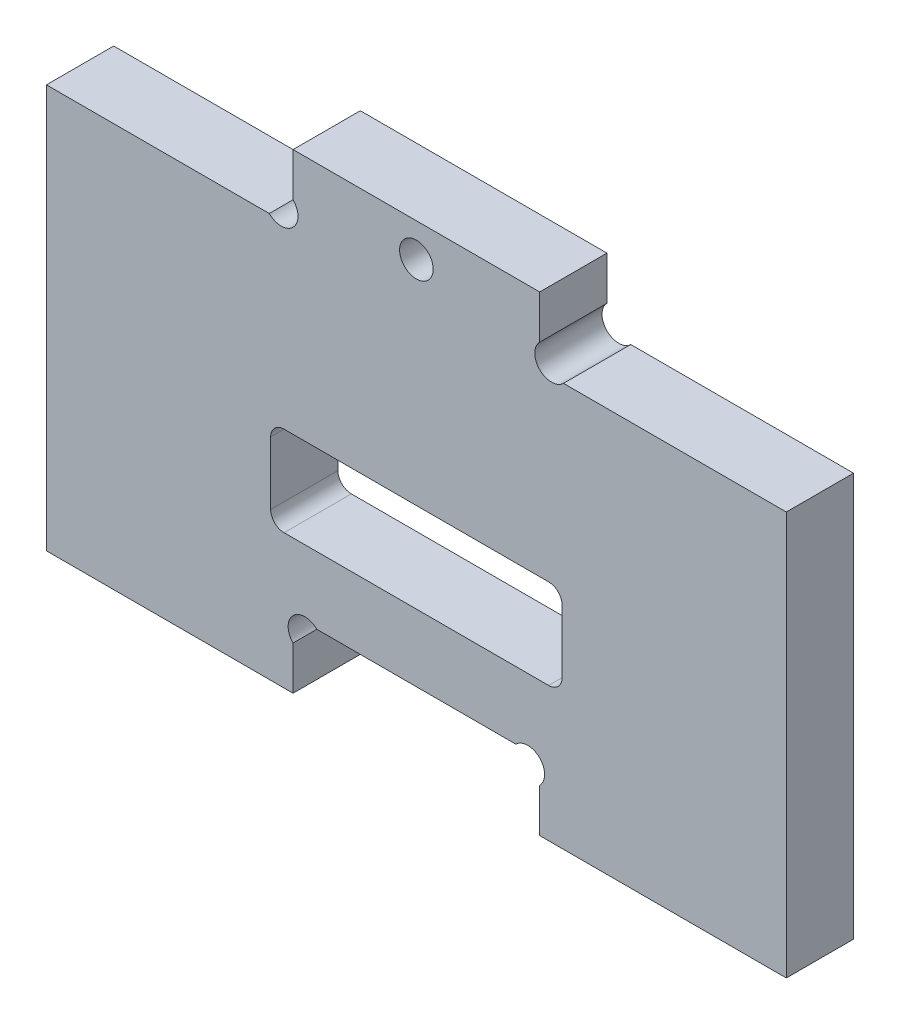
ISO-10303-21;
HEADER;
FILE_DESCRIPTION(('STEP AP214'),'2;1');
FILE_NAME('part.step','',(''),(''),'','','');
FILE_SCHEMA(('AUTOMOTIVE_DESIGN { 1 0 10303 214 1 1 1 1 }'));
ENDSEC;
DATA;
#1=APPLICATION_CONTEXT('core data for automotive mechanical design processes');
#2=APPLICATION_PROTOCOL_DEFINITION('international standard','automotive_design',2000,#1);
#3=PRODUCT_CONTEXT('',#1,'mechanical');
#4=PRODUCT('Part','Part','',(#3));
#5=PRODUCT_RELATED_PRODUCT_CATEGORY('part','',(#4));
#6=PRODUCT_DEFINITION_FORMATION('','',#4);
#7=PRODUCT_DEFINITION_CONTEXT('part definition',#1,'design');
#8=PRODUCT_DEFINITION('design','',#6,#7);
#9=PRODUCT_DEFINITION_SHAPE('','',#8);
#10=(LENGTH_UNIT() NAMED_UNIT(*) SI_UNIT(.MILLI.,.METRE.));
#11=(NAMED_UNIT(*) PLANE_ANGLE_UNIT() SI_UNIT($,.RADIAN.));
#12=(NAMED_UNIT(*) SI_UNIT($,.STERADIAN.) SOLID_ANGLE_UNIT());
#13=UNCERTAINTY_MEASURE_WITH_UNIT(LENGTH_MEASURE(1.E-05),#10,'distance_accuracy_value','');
#14=(GEOMETRIC_REPRESENTATION_CONTEXT(3) GLOBAL_UNCERTAINTY_ASSIGNED_CONTEXT((#13)) GLOBAL_UNIT_ASSIGNED_CONTEXT((#10,
#11,#12)) REPRESENTATION_CONTEXT('',''));
#15=CARTESIAN_POINT('',(0.,0.,0.));
#16=DIRECTION('',(0.,0.,1.));
#17=DIRECTION('',(1.,0.,0.));
#18=AXIS2_PLACEMENT_3D('',#15,#16,#17);
#19=CARTESIAN_POINT('',(23.0606601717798,4.93933982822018,6.));
#20=DIRECTION('',(0.,0.,1.));
#21=DIRECTION('',(1.,0.,0.));
#22=AXIS2_PLACEMENT_3D('',#19,#20,#21);
#23=PLANE('',#22);
#24=DIRECTION('',(0.,-1.,0.));
#25=VECTOR('',#24,1.);
#26=CARTESIAN_POINT('',(20.,18.8,6.));
#27=LINE('',#26,#25);
#28=CARTESIAN_POINT('',(20.,18.8,6.));
#29=VERTEX_POINT('',#28);
#30=CARTESIAN_POINT('',(20.,13.2,6.));
#31=VERTEX_POINT('',#30);
#32=EDGE_CURVE('E240',#29,#31,#27,.T.);
#33=ORIENTED_EDGE('',*,*,#32,.F.);
#34=CARTESIAN_POINT('',(21.2,18.8,6.));
#35=DIRECTION('',(0.,0.,1.));
#36=DIRECTION('',(-1.,0.,0.));
#37=AXIS2_PLACEMENT_3D('',#34,#35,#36);
#38=CIRCLE('',#37,1.2);
#39=CARTESIAN_POINT('',(21.2,20.,6.));
#40=VERTEX_POINT('',#39);
#41=EDGE_CURVE('E211',#40,#29,#38,.T.);
#42=ORIENTED_EDGE('',*,*,#41,.F.);
#43=DIRECTION('',(-1.,0.,0.));
#44=VECTOR('',#43,1.);
#45=CARTESIAN_POINT('',(21.2,20.,6.));
#46=LINE('',#45,#44);
#47=CARTESIAN_POINT('',(44.8,20.,6.));
#48=VERTEX_POINT('',#47);
#49=EDGE_CURVE('E252',#48,#40,#46,.T.);
#50=ORIENTED_EDGE('',*,*,#49,.F.);
#51=CARTESIAN_POINT('',(44.8,18.8,6.));
#52=DIRECTION('',(0.,0.,1.));
#53=DIRECTION('',(1.,0.,0.));
#54=AXIS2_PLACEMENT_3D('',#51,#52,#53);
#55=CIRCLE('',#54,1.2);
#56=CARTESIAN_POINT('',(46.,18.8,6.));
#57=VERTEX_POINT('',#56);
#58=EDGE_CURVE('E250',#57,#48,#55,.T.);
#59=ORIENTED_EDGE('',*,*,#58,.F.);
#60=DIRECTION('',(0.,1.,0.));
#61=VECTOR('',#60,1.);
#62=CARTESIAN_POINT('',(46.,18.8,6.));
#63=LINE('',#62,#61);
#64=CARTESIAN_POINT('',(46.,13.2,6.));
#65=VERTEX_POINT('',#64);
#66=EDGE_CURVE('E248',#65,#57,#63,.T.);
#67=ORIENTED_EDGE('',*,*,#66,.F.);
#68=CARTESIAN_POINT('',(44.8,13.2,6.));
#69=DIRECTION('',(0.,0.,1.));
#70=DIRECTION('',(-1.,0.,0.));
#71=AXIS2_PLACEMENT_3D('',#68,#69,#70);
#72=CIRCLE('',#71,1.2);
#73=CARTESIAN_POINT('',(44.8,12.,6.));
#74=VERTEX_POINT('',#73);
#75=EDGE_CURVE('E246',#74,#65,#72,.T.);
#76=ORIENTED_EDGE('',*,*,#75,.F.);
#77=DIRECTION('',(1.,0.,0.));
#78=VECTOR('',#77,1.);
#79=CARTESIAN_POINT('',(21.2,12.,6.));
#80=LINE('',#79,#78);
#81=CARTESIAN_POINT('',(21.2,12.,6.));
#82=VERTEX_POINT('',#81);
#83=EDGE_CURVE('E244',#82,#74,#80,.T.);
#84=ORIENTED_EDGE('',*,*,#83,.F.);
#85=CARTESIAN_POINT('',(21.2,13.2,6.));
#86=DIRECTION('',(0.,0.,1.));
#87=DIRECTION('',(1.,0.,0.));
#88=AXIS2_PLACEMENT_3D('',#85,#86,#87);
#89=CIRCLE('',#88,1.2);
#90=EDGE_CURVE('E242',#31,#82,#89,.T.);
#91=ORIENTED_EDGE('',*,*,#90,.F.);
#92=EDGE_LOOP('',(#33,#42,#50,#59,#67,#76,#84,#91));
#93=FACE_BOUND('',#92,.T.);
#94=CARTESIAN_POINT('',(23.0606601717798,4.93933982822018,6.));
#95=DIRECTION('',(0.,0.,-1.));
#96=DIRECTION('',(1.,0.,0.));
#97=AXIS2_PLACEMENT_3D('',#94,#95,#96);
#98=CIRCLE('',#97,1.5);
#99=CARTESIAN_POINT('',(22.,3.87867965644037,6.));
#100=VERTEX_POINT('',#99);
#101=CARTESIAN_POINT('',(24.1213203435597,5.99999999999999,6.));
#102=VERTEX_POINT('',#101);
#103=EDGE_CURVE('E298',#100,#102,#98,.T.);
#104=ORIENTED_EDGE('',*,*,#103,.T.);
#105=DIRECTION('',(1.,0.,0.));
#106=VECTOR('',#105,1.);
#107=CARTESIAN_POINT('',(41.8786796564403,5.99999999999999,6.));
#108=LINE('',#107,#106);
#109=CARTESIAN_POINT('',(41.8786796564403,5.99999999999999,6.));
#110=VERTEX_POINT('',#109);
#111=EDGE_CURVE('E301',#102,#110,#108,.T.);
#112=ORIENTED_EDGE('',*,*,#111,.T.);
#113=CARTESIAN_POINT('',(42.9393398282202,4.93933982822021,6.));
#114=DIRECTION('',(0.,0.,-1.));
#115=DIRECTION('',(-1.,0.,0.));
#116=AXIS2_PLACEMENT_3D('',#113,#114,#115);
#117=CIRCLE('',#116,1.5);
#118=CARTESIAN_POINT('',(44.,3.8786796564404,6.));
#119=VERTEX_POINT('',#118);
#120=EDGE_CURVE('E303',#110,#119,#117,.T.);
#121=ORIENTED_EDGE('',*,*,#120,.T.);
#122=DIRECTION('',(0.,-1.,0.));
#123=VECTOR('',#122,1.);
#124=CARTESIAN_POINT('',(44.,3.8786796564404,6.));
#125=LINE('',#124,#123);
#126=CARTESIAN_POINT('',(44.,0.,6.));
#127=VERTEX_POINT('',#126);
#128=EDGE_CURVE('E305',#119,#127,#125,.T.);
#129=ORIENTED_EDGE('',*,*,#128,.T.);
#130=DIRECTION('',(1.,0.,0.));
#131=VECTOR('',#130,1.);
#132=CARTESIAN_POINT('',(66.,0.,6.));
#133=LINE('',#132,#131);
#134=CARTESIAN_POINT('',(66.,0.,6.));
#135=VERTEX_POINT('',#134);
#136=EDGE_CURVE('E307',#127,#135,#133,.T.);
#137=ORIENTED_EDGE('',*,*,#136,.T.);
#138=DIRECTION('',(0.,1.,0.));
#139=VECTOR('',#138,1.);
#140=CARTESIAN_POINT('',(66.,36.,6.));
#141=LINE('',#140,#139);
#142=CARTESIAN_POINT('',(66.,36.,6.));
#143=VERTEX_POINT('',#142);
#144=EDGE_CURVE('E309',#135,#143,#141,.T.);
#145=ORIENTED_EDGE('',*,*,#144,.T.);
#146=DIRECTION('',(-1.,0.,0.));
#147=VECTOR('',#146,1.);
#148=CARTESIAN_POINT('',(46.1213203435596,36.,6.));
#149=LINE('',#148,#147);
#150=CARTESIAN_POINT('',(46.1213203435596,36.,6.));
#151=VERTEX_POINT('',#150);
#152=EDGE_CURVE('E311',#143,#151,#149,.T.);
#153=ORIENTED_EDGE('',*,*,#152,.T.);
#154=CARTESIAN_POINT('',(45.0606601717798,37.0606601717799,6.));
#155=DIRECTION('',(0.,0.,-1.));
#156=DIRECTION('',(-1.,0.,0.));
#157=AXIS2_PLACEMENT_3D('',#154,#155,#156);
#158=CIRCLE('',#157,1.5);
#159=CARTESIAN_POINT('',(44.,38.1213203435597,6.));
#160=VERTEX_POINT('',#159);
#161=EDGE_CURVE('E313',#151,#160,#158,.T.);
#162=ORIENTED_EDGE('',*,*,#161,.T.);
#163=DIRECTION('',(0.,1.,0.));
#164=VECTOR('',#163,1.);
#165=CARTESIAN_POINT('',(44.,38.1213203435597,6.));
#166=LINE('',#165,#164);
#167=CARTESIAN_POINT('',(44.,42.,6.));
#168=VERTEX_POINT('',#167);
#169=EDGE_CURVE('E315',#160,#168,#166,.T.);
#170=ORIENTED_EDGE('',*,*,#169,.T.);
#171=DIRECTION('',(-1.,0.,0.));
#172=VECTOR('',#171,1.);
#173=CARTESIAN_POINT('',(22.,42.,6.));
#174=LINE('',#173,#172);
#175=CARTESIAN_POINT('',(22.,42.,6.));
#176=VERTEX_POINT('',#175);
#177=EDGE_CURVE('E317',#168,#176,#174,.T.);
#178=ORIENTED_EDGE('',*,*,#177,.T.);
#179=DIRECTION('',(0.,-1.,0.));
#180=VECTOR('',#179,1.);
#181=CARTESIAN_POINT('',(22.,38.1213203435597,6.));
#182=LINE('',#181,#180);
#183=CARTESIAN_POINT('',(22.,38.1213203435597,6.));
#184=VERTEX_POINT('',#183);
#185=EDGE_CURVE('E319',#176,#184,#182,.T.);
#186=ORIENTED_EDGE('',*,*,#185,.T.);
#187=CARTESIAN_POINT('',(20.9393398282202,37.0606601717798,6.));
#188=DIRECTION('',(0.,0.,-1.));
#189=DIRECTION('',(1.,0.,0.));
#190=AXIS2_PLACEMENT_3D('',#187,#188,#189);
#191=CIRCLE('',#190,1.5);
#192=CARTESIAN_POINT('',(19.8786796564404,36.,6.));
#193=VERTEX_POINT('',#192);
#194=EDGE_CURVE('E321',#184,#193,#191,.T.);
#195=ORIENTED_EDGE('',*,*,#194,.T.);
#196=DIRECTION('',(-1.,0.,0.));
#197=VECTOR('',#196,1.);
#198=CARTESIAN_POINT('',(0.,36.,6.));
#199=LINE('',#198,#197);
#200=CARTESIAN_POINT('',(0.,36.,6.));
#201=VERTEX_POINT('',#200);
#202=EDGE_CURVE('E323',#193,#201,#199,.T.);
#203=ORIENTED_EDGE('',*,*,#202,.T.);
#204=DIRECTION('',(0.,-1.,0.));
#205=VECTOR('',#204,1.);
#206=CARTESIAN_POINT('',(0.,0.,6.));
#207=LINE('',#206,#205);
#208=CARTESIAN_POINT('',(0.,0.,6.));
#209=VERTEX_POINT('',#208);
#210=EDGE_CURVE('E325',#201,#209,#207,.T.);
#211=ORIENTED_EDGE('',*,*,#210,.T.);
#212=DIRECTION('',(1.,0.,0.));
#213=VECTOR('',#212,1.);
#214=CARTESIAN_POINT('',(22.,0.,6.));
#215=LINE('',#214,#213);
#216=CARTESIAN_POINT('',(22.,0.,6.));
#217=VERTEX_POINT('',#216);
#218=EDGE_CURVE('E327',#209,#217,#215,.T.);
#219=ORIENTED_EDGE('',*,*,#218,.T.);
#220=DIRECTION('',(0.,1.,0.));
#221=VECTOR('',#220,1.);
#222=CARTESIAN_POINT('',(22.,3.87867965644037,6.));
#223=LINE('',#222,#221);
#224=EDGE_CURVE('E329',#217,#100,#223,.T.);
#225=ORIENTED_EDGE('',*,*,#224,.T.);
#226=EDGE_LOOP('',(#104,#112,#121,#129,#137,#145,#153,#162,#170,#178,#186,#195,#203,#211,#219,#225));
#227=FACE_BOUND('',#226,.T.);
#228=CARTESIAN_POINT('',(33.,39.,6.));
#229=DIRECTION('',(0.,0.,1.));
#230=DIRECTION('',(1.,0.,0.));
#231=AXIS2_PLACEMENT_3D('',#228,#229,#230);
#232=CIRCLE('',#231,1.5);
#233=CARTESIAN_POINT('',(34.5,39.,6.));
#234=VERTEX_POINT('',#233);
#235=EDGE_CURVE('E219',#234,#234,#232,.T.);
#236=ORIENTED_EDGE('',*,*,#235,.F.);
#237=EDGE_LOOP('',(#236));
#238=FACE_BOUND('',#237,.T.);
#239=ADVANCED_FACE('F35',(#93,#227,#238),#23,.T.);
#240=CARTESIAN_POINT('',(23.0606601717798,4.93933982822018,0.));
#241=DIRECTION('',(0.,0.,1.));
#242=DIRECTION('',(1.,0.,0.));
#243=AXIS2_PLACEMENT_3D('',#240,#241,#242);
#244=PLANE('',#243);
#245=CARTESIAN_POINT('',(21.2,18.8,0.));
#246=DIRECTION('',(0.,0.,1.));
#247=DIRECTION('',(-1.,0.,0.));
#248=AXIS2_PLACEMENT_3D('',#245,#246,#247);
#249=CIRCLE('',#248,1.2);
#250=CARTESIAN_POINT('',(21.2,20.,0.));
#251=VERTEX_POINT('',#250);
#252=CARTESIAN_POINT('',(20.,18.8,0.));
#253=VERTEX_POINT('',#252);
#254=EDGE_CURVE('E58',#251,#253,#249,.T.);
#255=ORIENTED_EDGE('',*,*,#254,.T.);
#256=DIRECTION('',(0.,-1.,0.));
#257=VECTOR('',#256,1.);
#258=CARTESIAN_POINT('',(20.,18.8,0.));
#259=LINE('',#258,#257);
#260=CARTESIAN_POINT('',(20.,13.2,0.));
#261=VERTEX_POINT('',#260);
#262=EDGE_CURVE('E198',#253,#261,#259,.T.);
#263=ORIENTED_EDGE('',*,*,#262,.T.);
#264=CARTESIAN_POINT('',(21.2,13.2,0.));
#265=DIRECTION('',(0.,0.,1.));
#266=DIRECTION('',(1.,0.,0.));
#267=AXIS2_PLACEMENT_3D('',#264,#265,#266);
#268=CIRCLE('',#267,1.2);
#269=CARTESIAN_POINT('',(21.2,12.,0.));
#270=VERTEX_POINT('',#269);
#271=EDGE_CURVE('E207',#261,#270,#268,.T.);
#272=ORIENTED_EDGE('',*,*,#271,.T.);
#273=DIRECTION('',(1.,0.,0.));
#274=VECTOR('',#273,1.);
#275=CARTESIAN_POINT('',(21.2,12.,0.));
#276=LINE('',#275,#274);
#277=CARTESIAN_POINT('',(44.8,12.,0.));
#278=VERTEX_POINT('',#277);
#279=EDGE_CURVE('E227',#270,#278,#276,.T.);
#280=ORIENTED_EDGE('',*,*,#279,.T.);
#281=CARTESIAN_POINT('',(44.8,13.2,0.));
#282=DIRECTION('',(0.,0.,1.));
#283=DIRECTION('',(-1.,0.,0.));
#284=AXIS2_PLACEMENT_3D('',#281,#282,#283);
#285=CIRCLE('',#284,1.2);
#286=CARTESIAN_POINT('',(46.,13.2,0.));
#287=VERTEX_POINT('',#286);
#288=EDGE_CURVE('E230',#278,#287,#285,.T.);
#289=ORIENTED_EDGE('',*,*,#288,.T.);
#290=DIRECTION('',(0.,1.,0.));
#291=VECTOR('',#290,1.);
#292=CARTESIAN_POINT('',(46.,18.8,0.));
#293=LINE('',#292,#291);
#294=CARTESIAN_POINT('',(46.,18.8,0.));
#295=VERTEX_POINT('',#294);
#296=EDGE_CURVE('E233',#287,#295,#293,.T.);
#297=ORIENTED_EDGE('',*,*,#296,.T.);
#298=CARTESIAN_POINT('',(44.8,18.8,0.));
#299=DIRECTION('',(0.,0.,1.));
#300=DIRECTION('',(1.,0.,0.));
#301=AXIS2_PLACEMENT_3D('',#298,#299,#300);
#302=CIRCLE('',#301,1.2);
#303=CARTESIAN_POINT('',(44.8,20.,0.));
#304=VERTEX_POINT('',#303);
#305=EDGE_CURVE('E236',#295,#304,#302,.T.);
#306=ORIENTED_EDGE('',*,*,#305,.T.);
#307=DIRECTION('',(-1.,0.,0.));
#308=VECTOR('',#307,1.);
#309=CARTESIAN_POINT('',(21.2,20.,0.));
#310=LINE('',#309,#308);
#311=EDGE_CURVE('E218',#304,#251,#310,.T.);
#312=ORIENTED_EDGE('',*,*,#311,.T.);
#313=EDGE_LOOP('',(#255,#263,#272,#280,#289,#297,#306,#312));
#314=FACE_BOUND('',#313,.T.);
#315=CARTESIAN_POINT('',(23.0606601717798,4.93933982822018,0.));
#316=DIRECTION('',(0.,0.,-1.));
#317=DIRECTION('',(1.,0.,0.));
#318=AXIS2_PLACEMENT_3D('',#315,#316,#317);
#319=CIRCLE('',#318,1.5);
#320=CARTESIAN_POINT('',(22.,3.87867965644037,0.));
#321=VERTEX_POINT('',#320);
#322=CARTESIAN_POINT('',(24.1213203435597,5.99999999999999,0.));
#323=VERTEX_POINT('',#322);
#324=EDGE_CURVE('E212',#321,#323,#319,.T.);
#325=ORIENTED_EDGE('',*,*,#324,.F.);
#326=DIRECTION('',(0.,1.,0.));
#327=VECTOR('',#326,1.);
#328=CARTESIAN_POINT('',(22.,3.87867965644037,0.));
#329=LINE('',#328,#327);
#330=CARTESIAN_POINT('',(22.,0.,0.));
#331=VERTEX_POINT('',#330);
#332=EDGE_CURVE('E296',#331,#321,#329,.T.);
#333=ORIENTED_EDGE('',*,*,#332,.F.);
#334=DIRECTION('',(1.,0.,0.));
#335=VECTOR('',#334,1.);
#336=CARTESIAN_POINT('',(22.,0.,0.));
#337=LINE('',#336,#335);
#338=CARTESIAN_POINT('',(0.,0.,0.));
#339=VERTEX_POINT('',#338);
#340=EDGE_CURVE('E294',#339,#331,#337,.T.);
#341=ORIENTED_EDGE('',*,*,#340,.F.);
#342=DIRECTION('',(0.,-1.,0.));
#343=VECTOR('',#342,1.);
#344=CARTESIAN_POINT('',(0.,0.,0.));
#345=LINE('',#344,#343);
#346=CARTESIAN_POINT('',(0.,36.,0.));
#347=VERTEX_POINT('',#346);
#348=EDGE_CURVE('E292',#347,#339,#345,.T.);
#349=ORIENTED_EDGE('',*,*,#348,.F.);
#350=DIRECTION('',(-1.,0.,0.));
#351=VECTOR('',#350,1.);
#352=CARTESIAN_POINT('',(0.,36.,0.));
#353=LINE('',#352,#351);
#354=CARTESIAN_POINT('',(19.8786796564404,36.,0.));
#355=VERTEX_POINT('',#354);
#356=EDGE_CURVE('E290',#355,#347,#353,.T.);
#357=ORIENTED_EDGE('',*,*,#356,.F.);
#358=CARTESIAN_POINT('',(20.9393398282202,37.0606601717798,0.));
#359=DIRECTION('',(0.,0.,-1.));
#360=DIRECTION('',(1.,0.,0.));
#361=AXIS2_PLACEMENT_3D('',#358,#359,#360);
#362=CIRCLE('',#361,1.5);
#363=CARTESIAN_POINT('',(22.,38.1213203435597,0.));
#364=VERTEX_POINT('',#363);
#365=EDGE_CURVE('E288',#364,#355,#362,.T.);
#366=ORIENTED_EDGE('',*,*,#365,.F.);
#367=DIRECTION('',(0.,-1.,0.));
#368=VECTOR('',#367,1.);
#369=CARTESIAN_POINT('',(22.,38.1213203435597,0.));
#370=LINE('',#369,#368);
#371=CARTESIAN_POINT('',(22.,42.,0.));
#372=VERTEX_POINT('',#371);
#373=EDGE_CURVE('E286',#372,#364,#370,.T.);
#374=ORIENTED_EDGE('',*,*,#373,.F.);
#375=DIRECTION('',(-1.,0.,0.));
#376=VECTOR('',#375,1.);
#377=CARTESIAN_POINT('',(22.,42.,0.));
#378=LINE('',#377,#376);
#379=CARTESIAN_POINT('',(44.,42.,0.));
#380=VERTEX_POINT('',#379);
#381=EDGE_CURVE('E284',#380,#372,#378,.T.);
#382=ORIENTED_EDGE('',*,*,#381,.F.);
#383=DIRECTION('',(0.,1.,0.));
#384=VECTOR('',#383,1.);
#385=CARTESIAN_POINT('',(44.,38.1213203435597,0.));
#386=LINE('',#385,#384);
#387=CARTESIAN_POINT('',(44.,38.1213203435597,0.));
#388=VERTEX_POINT('',#387);
#389=EDGE_CURVE('E282',#388,#380,#386,.T.);
#390=ORIENTED_EDGE('',*,*,#389,.F.);
#391=CARTESIAN_POINT('',(45.0606601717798,37.0606601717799,0.));
#392=DIRECTION('',(0.,0.,-1.));
#393=DIRECTION('',(-1.,0.,0.));
#394=AXIS2_PLACEMENT_3D('',#391,#392,#393);
#395=CIRCLE('',#394,1.5);
#396=CARTESIAN_POINT('',(46.1213203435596,36.,0.));
#397=VERTEX_POINT('',#396);
#398=EDGE_CURVE('E280',#397,#388,#395,.T.);
#399=ORIENTED_EDGE('',*,*,#398,.F.);
#400=DIRECTION('',(-1.,0.,0.));
#401=VECTOR('',#400,1.);
#402=CARTESIAN_POINT('',(46.1213203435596,36.,0.));
#403=LINE('',#402,#401);
#404=CARTESIAN_POINT('',(66.,36.,0.));
#405=VERTEX_POINT('',#404);
#406=EDGE_CURVE('E278',#405,#397,#403,.T.);
#407=ORIENTED_EDGE('',*,*,#406,.F.);
#408=DIRECTION('',(0.,1.,0.));
#409=VECTOR('',#408,1.);
#410=CARTESIAN_POINT('',(66.,36.,0.));
#411=LINE('',#410,#409);
#412=CARTESIAN_POINT('',(66.,0.,0.));
#413=VERTEX_POINT('',#412);
#414=EDGE_CURVE('E276',#413,#405,#411,.T.);
#415=ORIENTED_EDGE('',*,*,#414,.F.);
#416=DIRECTION('',(1.,0.,0.));
#417=VECTOR('',#416,1.);
#418=CARTESIAN_POINT('',(66.,0.,0.));
#419=LINE('',#418,#417);
#420=CARTESIAN_POINT('',(44.,0.,0.));
#421=VERTEX_POINT('',#420);
#422=EDGE_CURVE('E274',#421,#413,#419,.T.);
#423=ORIENTED_EDGE('',*,*,#422,.F.);
#424=DIRECTION('',(0.,-1.,0.));
#425=VECTOR('',#424,1.);
#426=CARTESIAN_POINT('',(44.,3.8786796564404,0.));
#427=LINE('',#426,#425);
#428=CARTESIAN_POINT('',(44.,3.8786796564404,0.));
#429=VERTEX_POINT('',#428);
#430=EDGE_CURVE('E272',#429,#421,#427,.T.);
#431=ORIENTED_EDGE('',*,*,#430,.F.);
#432=CARTESIAN_POINT('',(42.9393398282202,4.93933982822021,0.));
#433=DIRECTION('',(0.,0.,-1.));
#434=DIRECTION('',(-1.,0.,0.));
#435=AXIS2_PLACEMENT_3D('',#432,#433,#434);
#436=CIRCLE('',#435,1.5);
#437=CARTESIAN_POINT('',(41.8786796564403,5.99999999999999,0.));
#438=VERTEX_POINT('',#437);
#439=EDGE_CURVE('E270',#438,#429,#436,.T.);
#440=ORIENTED_EDGE('',*,*,#439,.F.);
#441=DIRECTION('',(1.,0.,0.));
#442=VECTOR('',#441,1.);
#443=CARTESIAN_POINT('',(41.8786796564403,5.99999999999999,0.));
#444=LINE('',#443,#442);
#445=EDGE_CURVE('E268',#323,#438,#444,.T.);
#446=ORIENTED_EDGE('',*,*,#445,.F.);
#447=EDGE_LOOP('',(#325,#333,#341,#349,#357,#366,#374,#382,#390,#399,#407,#415,#423,#431,#440,#446));
#448=FACE_BOUND('',#447,.T.);
#449=CARTESIAN_POINT('',(33.,39.,0.));
#450=DIRECTION('',(0.,0.,1.));
#451=DIRECTION('',(1.,0.,0.));
#452=AXIS2_PLACEMENT_3D('',#449,#450,#451);
#453=CIRCLE('',#452,1.5);
#454=CARTESIAN_POINT('',(34.5,39.,0.));
#455=VERTEX_POINT('',#454);
#456=EDGE_CURVE('E222',#455,#455,#453,.T.);
#457=ORIENTED_EDGE('',*,*,#456,.T.);
#458=EDGE_LOOP('',(#457));
#459=FACE_BOUND('',#458,.T.);
#460=ADVANCED_FACE('F215',(#314,#448,#459),#244,.F.);
#461=CARTESIAN_POINT('',(23.0606601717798,4.93933982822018,6.));
#462=DIRECTION('',(0.,0.,-1.));
#463=DIRECTION('',(-1.,0.,0.));
#464=AXIS2_PLACEMENT_3D('',#461,#462,#463);
#465=CYLINDRICAL_SURFACE('',#464,1.5);
#466=ORIENTED_EDGE('',*,*,#324,.T.);
#467=DIRECTION('',(0.,0.,-1.));
#468=VECTOR('',#467,1.);
#469=CARTESIAN_POINT('',(24.1213203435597,5.99999999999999,6.));
#470=LINE('',#469,#468);
#471=EDGE_CURVE('E11',#102,#323,#470,.T.);
#472=ORIENTED_EDGE('',*,*,#471,.F.);
#473=ORIENTED_EDGE('',*,*,#103,.F.);
#474=DIRECTION('',(0.,0.,-1.));
#475=VECTOR('',#474,1.);
#476=CARTESIAN_POINT('',(22.,3.87867965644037,6.));
#477=LINE('',#476,#475);
#478=EDGE_CURVE('E331',#100,#321,#477,.T.);
#479=ORIENTED_EDGE('',*,*,#478,.T.);
#480=EDGE_LOOP('',(#466,#472,#473,#479));
#481=FACE_BOUND('',#480,.T.);
#482=ADVANCED_FACE('F37',(#481),#465,.F.);
#483=CARTESIAN_POINT('',(41.8786796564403,5.99999999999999,6.));
#484=DIRECTION('',(0.,1.,0.));
#485=DIRECTION('',(-1.,0.,0.));
#486=AXIS2_PLACEMENT_3D('',#483,#484,#485);
#487=PLANE('',#486);
#488=ORIENTED_EDGE('',*,*,#445,.T.);
#489=DIRECTION('',(0.,0.,-1.));
#490=VECTOR('',#489,1.);
#491=CARTESIAN_POINT('',(41.8786796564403,5.99999999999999,6.));
#492=LINE('',#491,#490);
#493=EDGE_CURVE('E43',#110,#438,#492,.T.);
#494=ORIENTED_EDGE('',*,*,#493,.F.);
#495=ORIENTED_EDGE('',*,*,#111,.F.);
#496=ORIENTED_EDGE('',*,*,#471,.T.);
#497=EDGE_LOOP('',(#488,#494,#495,#496));
#498=FACE_BOUND('',#497,.T.);
#499=ADVANCED_FACE('F399',(#498),#487,.F.);
#500=CARTESIAN_POINT('',(42.9393398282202,4.93933982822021,6.));
#501=DIRECTION('',(0.,0.,-1.));
#502=DIRECTION('',(-1.,0.,0.));
#503=AXIS2_PLACEMENT_3D('',#500,#501,#502);
#504=CYLINDRICAL_SURFACE('',#503,1.5);
#505=ORIENTED_EDGE('',*,*,#439,.T.);
#506=DIRECTION('',(0.,0.,-1.));
#507=VECTOR('',#506,1.);
#508=CARTESIAN_POINT('',(44.,3.8786796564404,6.));
#509=LINE('',#508,#507);
#510=EDGE_CURVE('E370',#119,#429,#509,.T.);
#511=ORIENTED_EDGE('',*,*,#510,.F.);
#512=ORIENTED_EDGE('',*,*,#120,.F.);
#513=ORIENTED_EDGE('',*,*,#493,.T.);
#514=EDGE_LOOP('',(#505,#511,#512,#513));
#515=FACE_BOUND('',#514,.T.);
#516=ADVANCED_FACE('F377',(#515),#504,.F.);
#517=CARTESIAN_POINT('',(44.,3.8786796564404,6.));
#518=DIRECTION('',(1.,0.,0.));
#519=DIRECTION('',(0.,0.,-1.));
#520=AXIS2_PLACEMENT_3D('',#517,#518,#519);
#521=PLANE('',#520);
#522=ORIENTED_EDGE('',*,*,#430,.T.);
#523=DIRECTION('',(0.,0.,-1.));
#524=VECTOR('',#523,1.);
#525=CARTESIAN_POINT('',(44.,0.,6.));
#526=LINE('',#525,#524);
#527=EDGE_CURVE('E367',#127,#421,#526,.T.);
#528=ORIENTED_EDGE('',*,*,#527,.F.);
#529=ORIENTED_EDGE('',*,*,#128,.F.);
#530=ORIENTED_EDGE('',*,*,#510,.T.);
#531=EDGE_LOOP('',(#522,#528,#529,#530));
#532=FACE_BOUND('',#531,.T.);
#533=ADVANCED_FACE('F387',(#532),#521,.F.);
#534=CARTESIAN_POINT('',(66.,0.,6.));
#535=DIRECTION('',(0.,1.,0.));
#536=DIRECTION('',(-1.,0.,0.));
#537=AXIS2_PLACEMENT_3D('',#534,#535,#536);
#538=PLANE('',#537);
#539=ORIENTED_EDGE('',*,*,#422,.T.);
#540=DIRECTION('',(0.,0.,-1.));
#541=VECTOR('',#540,1.);
#542=CARTESIAN_POINT('',(66.,0.,6.));
#543=LINE('',#542,#541);
#544=EDGE_CURVE('E364',#135,#413,#543,.T.);
#545=ORIENTED_EDGE('',*,*,#544,.F.);
#546=ORIENTED_EDGE('',*,*,#136,.F.);
#547=ORIENTED_EDGE('',*,*,#527,.T.);
#548=EDGE_LOOP('',(#539,#545,#546,#547));
#549=FACE_BOUND('',#548,.T.);
#550=ADVANCED_FACE('F391',(#549),#538,.F.);
#551=CARTESIAN_POINT('',(66.,36.,6.));
#552=DIRECTION('',(-1.,0.,0.));
#553=DIRECTION('',(0.,-1.,0.));
#554=AXIS2_PLACEMENT_3D('',#551,#552,#553);
#555=PLANE('',#554);
#556=ORIENTED_EDGE('',*,*,#414,.T.);
#557=DIRECTION('',(0.,0.,-1.));
#558=VECTOR('',#557,1.);
#559=CARTESIAN_POINT('',(66.,36.,6.));
#560=LINE('',#559,#558);
#561=EDGE_CURVE('E361',#143,#405,#560,.T.);
#562=ORIENTED_EDGE('',*,*,#561,.F.);
#563=ORIENTED_EDGE('',*,*,#144,.F.);
#564=ORIENTED_EDGE('',*,*,#544,.T.);
#565=EDGE_LOOP('',(#556,#562,#563,#564));
#566=FACE_BOUND('',#565,.T.);
#567=ADVANCED_FACE('F452',(#566),#555,.F.);
#568=CARTESIAN_POINT('',(46.1213203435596,36.,6.));
#569=DIRECTION('',(0.,-1.,0.));
#570=DIRECTION('',(1.,0.,0.));
#571=AXIS2_PLACEMENT_3D('',#568,#569,#570);
#572=PLANE('',#571);
#573=ORIENTED_EDGE('',*,*,#406,.T.);
#574=DIRECTION('',(0.,0.,-1.));
#575=VECTOR('',#574,1.);
#576=CARTESIAN_POINT('',(46.1213203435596,36.,6.));
#577=LINE('',#576,#575);
#578=EDGE_CURVE('E358',#151,#397,#577,.T.);
#579=ORIENTED_EDGE('',*,*,#578,.F.);
#580=ORIENTED_EDGE('',*,*,#152,.F.);
#581=ORIENTED_EDGE('',*,*,#561,.T.);
#582=EDGE_LOOP('',(#573,#579,#580,#581));
#583=FACE_BOUND('',#582,.T.);
#584=ADVANCED_FACE('F449',(#583),#572,.F.);
#585=CARTESIAN_POINT('',(45.0606601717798,37.0606601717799,6.));
#586=DIRECTION('',(0.,0.,-1.));
#587=DIRECTION('',(-1.,0.,0.));
#588=AXIS2_PLACEMENT_3D('',#585,#586,#587);
#589=CYLINDRICAL_SURFACE('',#588,1.5);
#590=ORIENTED_EDGE('',*,*,#398,.T.);
#591=DIRECTION('',(0.,0.,-1.));
#592=VECTOR('',#591,1.);
#593=CARTESIAN_POINT('',(44.,38.1213203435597,6.));
#594=LINE('',#593,#592);
#595=EDGE_CURVE('E355',#160,#388,#594,.T.);
#596=ORIENTED_EDGE('',*,*,#595,.F.);
#597=ORIENTED_EDGE('',*,*,#161,.F.);
#598=ORIENTED_EDGE('',*,*,#578,.T.);
#599=EDGE_LOOP('',(#590,#596,#597,#598));
#600=FACE_BOUND('',#599,.T.);
#601=ADVANCED_FACE('F445',(#600),#589,.F.);
#602=CARTESIAN_POINT('',(44.,38.1213203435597,6.));
#603=DIRECTION('',(-1.,0.,0.));
#604=DIRECTION('',(0.,0.,1.));
#605=AXIS2_PLACEMENT_3D('',#602,#603,#604);
#606=PLANE('',#605);
#607=ORIENTED_EDGE('',*,*,#389,.T.);
#608=DIRECTION('',(0.,0.,-1.));
#609=VECTOR('',#608,1.);
#610=CARTESIAN_POINT('',(44.,42.,6.));
#611=LINE('',#610,#609);
#612=EDGE_CURVE('E352',#168,#380,#611,.T.);
#613=ORIENTED_EDGE('',*,*,#612,.F.);
#614=ORIENTED_EDGE('',*,*,#169,.F.);
#615=ORIENTED_EDGE('',*,*,#595,.T.);
#616=EDGE_LOOP('',(#607,#613,#614,#615));
#617=FACE_BOUND('',#616,.T.);
#618=ADVANCED_FACE('F441',(#617),#606,.F.);
#619=CARTESIAN_POINT('',(22.,42.,6.));
#620=DIRECTION('',(0.,-1.,0.));
#621=DIRECTION('',(1.,0.,0.));
#622=AXIS2_PLACEMENT_3D('',#619,#620,#621);
#623=PLANE('',#622);
#624=ORIENTED_EDGE('',*,*,#381,.T.);
#625=DIRECTION('',(0.,0.,-1.));
#626=VECTOR('',#625,1.);
#627=CARTESIAN_POINT('',(22.,42.,6.));
#628=LINE('',#627,#626);
#629=EDGE_CURVE('E349',#176,#372,#628,.T.);
#630=ORIENTED_EDGE('',*,*,#629,.F.);
#631=ORIENTED_EDGE('',*,*,#177,.F.);
#632=ORIENTED_EDGE('',*,*,#612,.T.);
#633=EDGE_LOOP('',(#624,#630,#631,#632));
#634=FACE_BOUND('',#633,.T.);
#635=ADVANCED_FACE('F436',(#634),#623,.F.);
#636=CARTESIAN_POINT('',(22.,38.1213203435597,6.));
#637=DIRECTION('',(1.,0.,0.));
#638=DIRECTION('',(0.,0.,-1.));
#639=AXIS2_PLACEMENT_3D('',#636,#637,#638);
#640=PLANE('',#639);
#641=ORIENTED_EDGE('',*,*,#373,.T.);
#642=DIRECTION('',(0.,0.,-1.));
#643=VECTOR('',#642,1.);
#644=CARTESIAN_POINT('',(22.,38.1213203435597,6.));
#645=LINE('',#644,#643);
#646=EDGE_CURVE('E346',#184,#364,#645,.T.);
#647=ORIENTED_EDGE('',*,*,#646,.F.);
#648=ORIENTED_EDGE('',*,*,#185,.F.);
#649=ORIENTED_EDGE('',*,*,#629,.T.);
#650=EDGE_LOOP('',(#641,#647,#648,#649));
#651=FACE_BOUND('',#650,.T.);
#652=ADVANCED_FACE('F430',(#651),#640,.F.);
#653=CARTESIAN_POINT('',(20.9393398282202,37.0606601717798,6.));
#654=DIRECTION('',(0.,0.,-1.));
#655=DIRECTION('',(-1.,0.,0.));
#656=AXIS2_PLACEMENT_3D('',#653,#654,#655);
#657=CYLINDRICAL_SURFACE('',#656,1.5);
#658=ORIENTED_EDGE('',*,*,#365,.T.);
#659=DIRECTION('',(0.,0.,-1.));
#660=VECTOR('',#659,1.);
#661=CARTESIAN_POINT('',(19.8786796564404,36.,6.));
#662=LINE('',#661,#660);
#663=EDGE_CURVE('E343',#193,#355,#662,.T.);
#664=ORIENTED_EDGE('',*,*,#663,.F.);
#665=ORIENTED_EDGE('',*,*,#194,.F.);
#666=ORIENTED_EDGE('',*,*,#646,.T.);
#667=EDGE_LOOP('',(#658,#664,#665,#666));
#668=FACE_BOUND('',#667,.T.);
#669=ADVANCED_FACE('F426',(#668),#657,.F.);
#670=CARTESIAN_POINT('',(0.,36.,6.));
#671=DIRECTION('',(0.,-1.,0.));
#672=DIRECTION('',(1.,0.,0.));
#673=AXIS2_PLACEMENT_3D('',#670,#671,#672);
#674=PLANE('',#673);
#675=ORIENTED_EDGE('',*,*,#356,.T.);
#676=DIRECTION('',(0.,0.,-1.));
#677=VECTOR('',#676,1.);
#678=CARTESIAN_POINT('',(0.,36.,6.));
#679=LINE('',#678,#677);
#680=EDGE_CURVE('E340',#201,#347,#679,.T.);
#681=ORIENTED_EDGE('',*,*,#680,.F.);
#682=ORIENTED_EDGE('',*,*,#202,.F.);
#683=ORIENTED_EDGE('',*,*,#663,.T.);
#684=EDGE_LOOP('',(#675,#681,#682,#683));
#685=FACE_BOUND('',#684,.T.);
#686=ADVANCED_FACE('F421',(#685),#674,.F.);
#687=CARTESIAN_POINT('',(0.,0.,6.));
#688=DIRECTION('',(1.,0.,0.));
#689=DIRECTION('',(0.,0.,-1.));
#690=AXIS2_PLACEMENT_3D('',#687,#688,#689);
#691=PLANE('',#690);
#692=ORIENTED_EDGE('',*,*,#348,.T.);
#693=DIRECTION('',(0.,0.,-1.));
#694=VECTOR('',#693,1.);
#695=CARTESIAN_POINT('',(0.,0.,6.));
#696=LINE('',#695,#694);
#697=EDGE_CURVE('E337',#209,#339,#696,.T.);
#698=ORIENTED_EDGE('',*,*,#697,.F.);
#699=ORIENTED_EDGE('',*,*,#210,.F.);
#700=ORIENTED_EDGE('',*,*,#680,.T.);
#701=EDGE_LOOP('',(#692,#698,#699,#700));
#702=FACE_BOUND('',#701,.T.);
#703=ADVANCED_FACE('F415',(#702),#691,.F.);
#704=CARTESIAN_POINT('',(22.,0.,6.));
#705=DIRECTION('',(0.,1.,0.));
#706=DIRECTION('',(0.,0.,1.));
#707=AXIS2_PLACEMENT_3D('',#704,#705,#706);
#708=PLANE('',#707);
#709=ORIENTED_EDGE('',*,*,#340,.T.);
#710=DIRECTION('',(0.,0.,-1.));
#711=VECTOR('',#710,1.);
#712=CARTESIAN_POINT('',(22.,0.,6.));
#713=LINE('',#712,#711);
#714=EDGE_CURVE('E334',#217,#331,#713,.T.);
#715=ORIENTED_EDGE('',*,*,#714,.F.);
#716=ORIENTED_EDGE('',*,*,#218,.F.);
#717=ORIENTED_EDGE('',*,*,#697,.T.);
#718=EDGE_LOOP('',(#709,#715,#716,#717));
#719=FACE_BOUND('',#718,.T.);
#720=ADVANCED_FACE('F411',(#719),#708,.F.);
#721=CARTESIAN_POINT('',(22.,3.87867965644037,6.));
#722=DIRECTION('',(-1.,0.,0.));
#723=DIRECTION('',(0.,0.,1.));
#724=AXIS2_PLACEMENT_3D('',#721,#722,#723);
#725=PLANE('',#724);
#726=ORIENTED_EDGE('',*,*,#332,.T.);
#727=ORIENTED_EDGE('',*,*,#478,.F.);
#728=ORIENTED_EDGE('',*,*,#224,.F.);
#729=ORIENTED_EDGE('',*,*,#714,.T.);
#730=EDGE_LOOP('',(#726,#727,#728,#729));
#731=FACE_BOUND('',#730,.T.);
#732=ADVANCED_FACE('F406',(#731),#725,.F.);
#733=CARTESIAN_POINT('',(21.2,18.8,6.));
#734=DIRECTION('',(0.,0.,-1.));
#735=DIRECTION('',(-1.,0.,0.));
#736=AXIS2_PLACEMENT_3D('',#733,#734,#735);
#737=CYLINDRICAL_SURFACE('',#736,1.2);
#738=ORIENTED_EDGE('',*,*,#254,.F.);
#739=DIRECTION('',(0.,0.,-1.));
#740=VECTOR('',#739,1.);
#741=CARTESIAN_POINT('',(21.2,20.,6.));
#742=LINE('',#741,#740);
#743=EDGE_CURVE('E254',#40,#251,#742,.T.);
#744=ORIENTED_EDGE('',*,*,#743,.F.);
#745=ORIENTED_EDGE('',*,*,#41,.T.);
#746=DIRECTION('',(0.,0.,-1.));
#747=VECTOR('',#746,1.);
#748=CARTESIAN_POINT('',(20.,18.8,6.));
#749=LINE('',#748,#747);
#750=EDGE_CURVE('E200',#29,#253,#749,.T.);
#751=ORIENTED_EDGE('',*,*,#750,.T.);
#752=EDGE_LOOP('',(#738,#744,#745,#751));
#753=FACE_BOUND('',#752,.T.);
#754=ADVANCED_FACE('F209',(#753),#737,.F.);
#755=CARTESIAN_POINT('',(20.,18.8,6.));
#756=DIRECTION('',(1.,0.,0.));
#757=DIRECTION('',(0.,0.,-1.));
#758=AXIS2_PLACEMENT_3D('',#755,#756,#757);
#759=PLANE('',#758);
#760=ORIENTED_EDGE('',*,*,#262,.F.);
#761=ORIENTED_EDGE('',*,*,#750,.F.);
#762=ORIENTED_EDGE('',*,*,#32,.T.);
#763=DIRECTION('',(0.,0.,-1.));
#764=VECTOR('',#763,1.);
#765=CARTESIAN_POINT('',(20.,13.2,6.));
#766=LINE('',#765,#764);
#767=EDGE_CURVE('E203',#31,#261,#766,.T.);
#768=ORIENTED_EDGE('',*,*,#767,.T.);
#769=EDGE_LOOP('',(#760,#761,#762,#768));
#770=FACE_BOUND('',#769,.T.);
#771=ADVANCED_FACE('F199',(#770),#759,.T.);
#772=CARTESIAN_POINT('',(21.2,13.2,6.));
#773=DIRECTION('',(0.,0.,-1.));
#774=DIRECTION('',(-1.,0.,0.));
#775=AXIS2_PLACEMENT_3D('',#772,#773,#774);
#776=CYLINDRICAL_SURFACE('',#775,1.2);
#777=ORIENTED_EDGE('',*,*,#271,.F.);
#778=ORIENTED_EDGE('',*,*,#767,.F.);
#779=ORIENTED_EDGE('',*,*,#90,.T.);
#780=DIRECTION('',(0.,0.,-1.));
#781=VECTOR('',#780,1.);
#782=CARTESIAN_POINT('',(21.2,12.,6.));
#783=LINE('',#782,#781);
#784=EDGE_CURVE('E263',#82,#270,#783,.T.);
#785=ORIENTED_EDGE('',*,*,#784,.T.);
#786=EDGE_LOOP('',(#777,#778,#779,#785));
#787=FACE_BOUND('',#786,.T.);
#788=ADVANCED_FACE('F534',(#787),#776,.F.);
#789=CARTESIAN_POINT('',(21.2,12.,6.));
#790=DIRECTION('',(0.,1.,0.));
#791=DIRECTION('',(-1.,0.,0.));
#792=AXIS2_PLACEMENT_3D('',#789,#790,#791);
#793=PLANE('',#792);
#794=ORIENTED_EDGE('',*,*,#279,.F.);
#795=ORIENTED_EDGE('',*,*,#784,.F.);
#796=ORIENTED_EDGE('',*,*,#83,.T.);
#797=DIRECTION('',(0.,0.,-1.));
#798=VECTOR('',#797,1.);
#799=CARTESIAN_POINT('',(44.8,12.,6.));
#800=LINE('',#799,#798);
#801=EDGE_CURVE('E261',#74,#278,#800,.T.);
#802=ORIENTED_EDGE('',*,*,#801,.T.);
#803=EDGE_LOOP('',(#794,#795,#796,#802));
#804=FACE_BOUND('',#803,.T.);
#805=ADVANCED_FACE('F541',(#804),#793,.T.);
#806=CARTESIAN_POINT('',(44.8,13.2,6.));
#807=DIRECTION('',(0.,0.,-1.));
#808=DIRECTION('',(-1.,0.,0.));
#809=AXIS2_PLACEMENT_3D('',#806,#807,#808);
#810=CYLINDRICAL_SURFACE('',#809,1.2);
#811=ORIENTED_EDGE('',*,*,#288,.F.);
#812=ORIENTED_EDGE('',*,*,#801,.F.);
#813=ORIENTED_EDGE('',*,*,#75,.T.);
#814=DIRECTION('',(0.,0.,-1.));
#815=VECTOR('',#814,1.);
#816=CARTESIAN_POINT('',(46.,13.2,6.));
#817=LINE('',#816,#815);
#818=EDGE_CURVE('E259',#65,#287,#817,.T.);
#819=ORIENTED_EDGE('',*,*,#818,.T.);
#820=EDGE_LOOP('',(#811,#812,#813,#819));
#821=FACE_BOUND('',#820,.T.);
#822=ADVANCED_FACE('F549',(#821),#810,.F.);
#823=CARTESIAN_POINT('',(46.,18.8,6.));
#824=DIRECTION('',(-1.,0.,0.));
#825=DIRECTION('',(0.,0.,1.));
#826=AXIS2_PLACEMENT_3D('',#823,#824,#825);
#827=PLANE('',#826);
#828=ORIENTED_EDGE('',*,*,#296,.F.);
#829=ORIENTED_EDGE('',*,*,#818,.F.);
#830=ORIENTED_EDGE('',*,*,#66,.T.);
#831=DIRECTION('',(0.,0.,-1.));
#832=VECTOR('',#831,1.);
#833=CARTESIAN_POINT('',(46.,18.8,6.));
#834=LINE('',#833,#832);
#835=EDGE_CURVE('E257',#57,#295,#834,.T.);
#836=ORIENTED_EDGE('',*,*,#835,.T.);
#837=EDGE_LOOP('',(#828,#829,#830,#836));
#838=FACE_BOUND('',#837,.T.);
#839=ADVANCED_FACE('F557',(#838),#827,.T.);
#840=CARTESIAN_POINT('',(44.8,18.8,6.));
#841=DIRECTION('',(0.,0.,-1.));
#842=DIRECTION('',(-1.,0.,0.));
#843=AXIS2_PLACEMENT_3D('',#840,#841,#842);
#844=CYLINDRICAL_SURFACE('',#843,1.2);
#845=ORIENTED_EDGE('',*,*,#305,.F.);
#846=ORIENTED_EDGE('',*,*,#835,.F.);
#847=ORIENTED_EDGE('',*,*,#58,.T.);
#848=DIRECTION('',(0.,0.,-1.));
#849=VECTOR('',#848,1.);
#850=CARTESIAN_POINT('',(44.8,20.,6.));
#851=LINE('',#850,#849);
#852=EDGE_CURVE('E50',#48,#304,#851,.T.);
#853=ORIENTED_EDGE('',*,*,#852,.T.);
#854=EDGE_LOOP('',(#845,#846,#847,#853));
#855=FACE_BOUND('',#854,.T.);
#856=ADVANCED_FACE('F565',(#855),#844,.F.);
#857=CARTESIAN_POINT('',(21.2,20.,6.));
#858=DIRECTION('',(0.,-1.,0.));
#859=DIRECTION('',(1.,0.,0.));
#860=AXIS2_PLACEMENT_3D('',#857,#858,#859);
#861=PLANE('',#860);
#862=ORIENTED_EDGE('',*,*,#311,.F.);
#863=ORIENTED_EDGE('',*,*,#852,.F.);
#864=ORIENTED_EDGE('',*,*,#49,.T.);
#865=ORIENTED_EDGE('',*,*,#743,.T.);
#866=EDGE_LOOP('',(#862,#863,#864,#865));
#867=FACE_BOUND('',#866,.T.);
#868=ADVANCED_FACE('F573',(#867),#861,.T.);
#869=CARTESIAN_POINT('',(33.,39.,6.));
#870=DIRECTION('',(0.,0.,-1.));
#871=DIRECTION('',(-1.,0.,0.));
#872=AXIS2_PLACEMENT_3D('',#869,#870,#871);
#873=CYLINDRICAL_SURFACE('',#872,1.5);
#874=ORIENTED_EDGE('',*,*,#235,.T.);
#875=EDGE_LOOP('',(#874));
#876=FACE_BOUND('',#875,.T.);
#877=ORIENTED_EDGE('',*,*,#456,.F.);
#878=EDGE_LOOP('',(#877));
#879=FACE_BOUND('',#878,.T.);
#880=ADVANCED_FACE('F581',(#876,#879),#873,.F.);
#881=CLOSED_SHELL('',(#239,#460,#482,#499,#516,#533,#550,#567,#584,#601,#618,#635,#652,#669,
#686,#703,#720,#732,#754,#771,#788,#805,#822,#839,#856,#868,#880));
#882=MANIFOLD_SOLID_BREP('B2',#881);
#883=ADVANCED_BREP_SHAPE_REPRESENTATION('',(#18,#882),#14);
#884=SHAPE_DEFINITION_REPRESENTATION(#9,#883);
ENDSEC;
END-ISO-10303-21;
